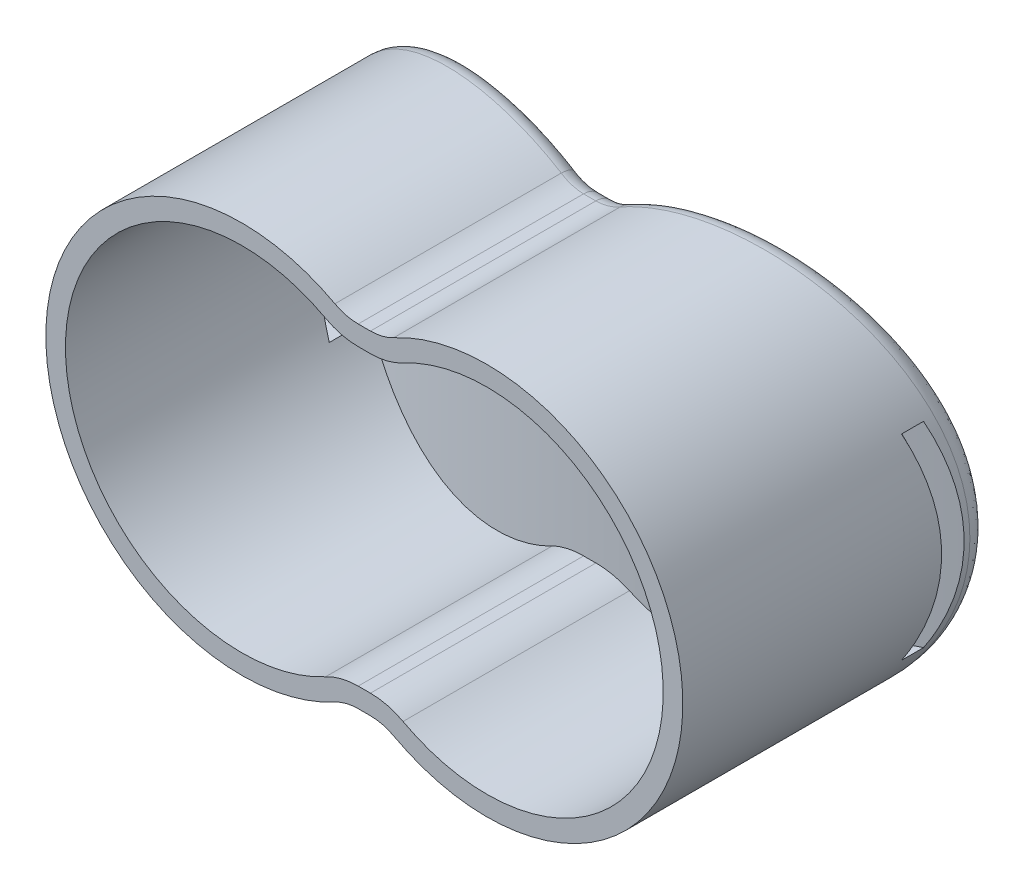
from build123d import *
from build123d.topology import SkipClean

# Parameters (mm, degrees)
EXTRUSION1_DEPTH             = 35
ENL_V_MAT_EXTRU_1_DEPTH      = 35
ENL_V_MAT_EXTRU_1_DEPTH_BACK = 35
ESQUISSE2_R                  = 75
CONG_3_R                     = 2
COQUE1_T                     = -2
ENL_V_MAT_EXTRU_2_DEPTH      = 10
ENL_V_MAT_EXTRU_2_DEPTH_BACK = 10
ESQUISSE3_R                  = 67
ESQUISSE3_R_2                = 65


with BuildPart() as part:
    # Esquisse1 → Extrusion1 (new body)
    with BuildSketch(Plane.XY):
        with BuildLine():
            Line((-0.625657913, 17), (0.625657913, 17))
            ThreePointArc((0.625657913, 17), (1.850402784, 17.152320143), (3.00052633, 17.6))
            ThreePointArc((3.00052633, 17.6), (32.5, 0), (3.00052633, -17.6))
            ThreePointArc((3.00052633, -17.6), (1.850402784, -17.152320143), (0.625657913, -17))
            Line((0.625657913, -17), (-0.625657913, -17))
            ThreePointArc((-0.625657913, -17), (-1.850402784, -17.152320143), (-3.00052633, -17.6))
            ThreePointArc((-3.00052633, -17.6), (-32.5, 0), (-3.00052633, 17.6))
            ThreePointArc((-3.00052633, 17.6), (-1.850402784, 17.152320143), (-0.625657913, 17))
        make_face()
    extrude(amount=-EXTRUSION1_DEPTH)

    # Esquisse2 → Enl_v. mat.-Extru.1 (cut, two sides: drawn at the far end of the back side and taken through both)
    with BuildSketch(Plane(origin=(0, 0, 0), x_dir=(1, 0, 0), z_dir=(0, 1, 0)).offset(-ENL_V_MAT_EXTRU_1_DEPTH_BACK)):
        with Locations((0, 100)):
            Circle(ESQUISSE2_R)
    extrude(amount=ENL_V_MAT_EXTRU_1_DEPTH + ENL_V_MAT_EXTRU_1_DEPTH_BACK, mode=Mode.SUBTRACT)

    # Cong_3
    cong_3_edges = [part.edges().sort_by_distance(p)[0] for p in [
        (-32.5, 0, -32.407470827),
        (0, 17, -25),
        (-1.850590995, 17.152367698, -25.022834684),
        (-1.850590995, -17.152367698, -25.022834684),
        (0, -17, -25),
        (1.850590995, -17.152367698, -25.022834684),
        (32.5, 0, -32.407470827),
        (1.850590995, 17.152367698, -25.022834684),
    ]]
    fillet(cong_3_edges, radius=CONG_3_R)

    # Coque1
    coque1_openings = [part.faces().sort_by_distance(p)[0] for p in [
        (0, 0, 0),
    ]]
    offset(amount=COQUE1_T, openings=coque1_openings, kind=Kind.INTERSECTION)

    # Esquisse3 → Enl_v. mat.-Extru.2 (cut, two sides: drawn at the far end of the back side and taken through both)
    with SkipClean():  # the faces are left unmerged after this step: merging them gives an invalid solid
        with BuildSketch(Plane(origin=(0, 0, 0), x_dir=(1, 0, 0), z_dir=(0, 1, 0)).offset(-ENL_V_MAT_EXTRU_2_DEPTH_BACK)):
            with Locations((0, 85)):
                Circle(ESQUISSE3_R)
            with Locations((0, 85)):
                Circle(ESQUISSE3_R_2, mode=Mode.SUBTRACT)
        extrude(amount=ENL_V_MAT_EXTRU_2_DEPTH + ENL_V_MAT_EXTRU_2_DEPTH_BACK, mode=Mode.SUBTRACT)


solid = part.part
